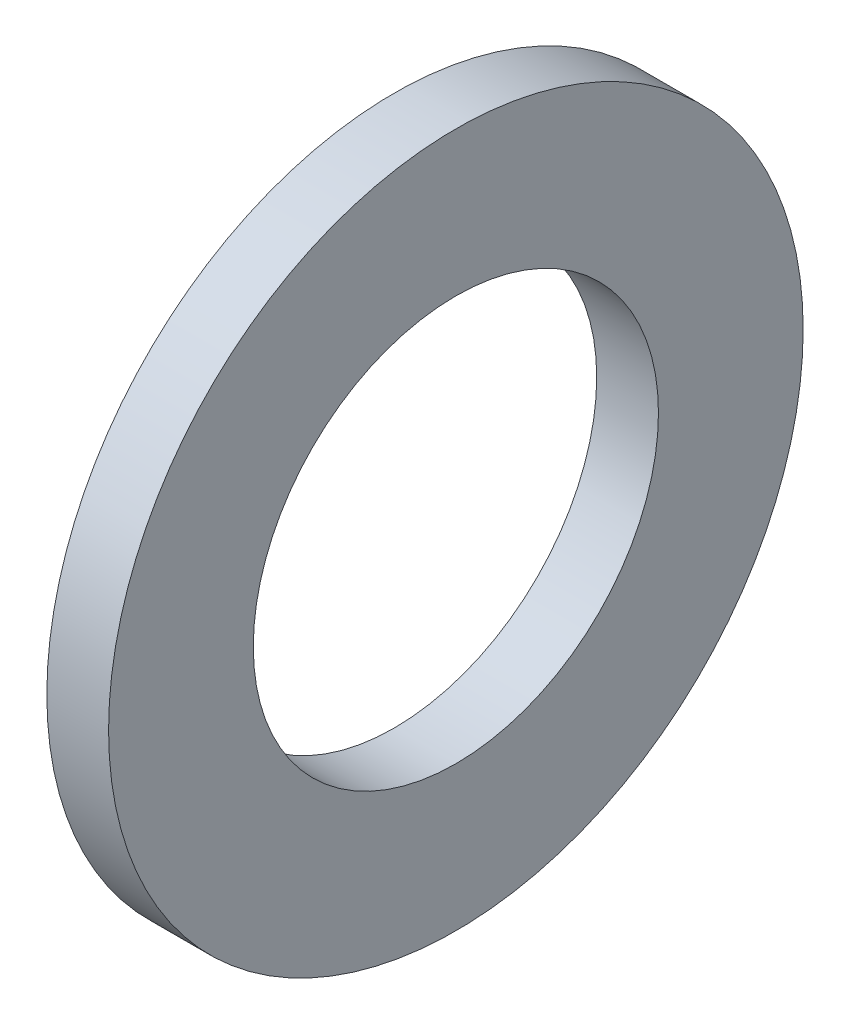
ISO-10303-21;
HEADER;
FILE_DESCRIPTION(('STEP AP214'),'2;1');
FILE_NAME('part.step','',(''),(''),'','','');
FILE_SCHEMA(('AUTOMOTIVE_DESIGN { 1 0 10303 214 1 1 1 1 }'));
ENDSEC;
DATA;
#1=APPLICATION_CONTEXT('core data for automotive mechanical design processes');
#2=APPLICATION_PROTOCOL_DEFINITION('international standard','automotive_design',2000,#1);
#3=PRODUCT_CONTEXT('',#1,'mechanical');
#4=PRODUCT('Part','Part','',(#3));
#5=PRODUCT_RELATED_PRODUCT_CATEGORY('part','',(#4));
#6=PRODUCT_DEFINITION_FORMATION('','',#4);
#7=PRODUCT_DEFINITION_CONTEXT('part definition',#1,'design');
#8=PRODUCT_DEFINITION('design','',#6,#7);
#9=PRODUCT_DEFINITION_SHAPE('','',#8);
#10=(LENGTH_UNIT() NAMED_UNIT(*) SI_UNIT(.MILLI.,.METRE.));
#11=(NAMED_UNIT(*) PLANE_ANGLE_UNIT() SI_UNIT($,.RADIAN.));
#12=(NAMED_UNIT(*) SI_UNIT($,.STERADIAN.) SOLID_ANGLE_UNIT());
#13=UNCERTAINTY_MEASURE_WITH_UNIT(LENGTH_MEASURE(1.E-05),#10,'distance_accuracy_value','');
#14=(GEOMETRIC_REPRESENTATION_CONTEXT(3) GLOBAL_UNCERTAINTY_ASSIGNED_CONTEXT((#13)) GLOBAL_UNIT_ASSIGNED_CONTEXT((#10,
#11,#12)) REPRESENTATION_CONTEXT('',''));
#15=CARTESIAN_POINT('',(0.,0.,0.));
#16=DIRECTION('',(0.,0.,1.));
#17=DIRECTION('',(1.,0.,0.));
#18=AXIS2_PLACEMENT_3D('',#15,#16,#17);
#19=CARTESIAN_POINT('',(-34.9249999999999,0.,0.));
#20=DIRECTION('',(-1.,0.,0.));
#21=DIRECTION('',(0.,0.,1.));
#22=AXIS2_PLACEMENT_3D('',#19,#20,#21);
#23=CYLINDRICAL_SURFACE('',#22,5.25);
#24=CARTESIAN_POINT('',(0.,0.,0.));
#25=DIRECTION('',(-1.,0.,0.));
#26=DIRECTION('',(0.,0.,1.));
#27=AXIS2_PLACEMENT_3D('',#24,#25,#26);
#28=CIRCLE('',#27,5.25);
#29=CARTESIAN_POINT('',(0.,0.,5.25));
#30=VERTEX_POINT('',#29);
#31=EDGE_CURVE('E10',#30,#30,#28,.T.);
#32=ORIENTED_EDGE('',*,*,#31,.F.);
#33=EDGE_LOOP('',(#32));
#34=FACE_BOUND('',#33,.T.);
#35=CARTESIAN_POINT('',(-1.6,0.,0.));
#36=DIRECTION('',(-1.,0.,0.));
#37=DIRECTION('',(0.,0.,1.));
#38=AXIS2_PLACEMENT_3D('',#35,#36,#37);
#39=CIRCLE('',#38,5.25);
#40=CARTESIAN_POINT('',(-1.6,0.,5.25));
#41=VERTEX_POINT('',#40);
#42=EDGE_CURVE('E46',#41,#41,#39,.T.);
#43=ORIENTED_EDGE('',*,*,#42,.T.);
#44=EDGE_LOOP('',(#43));
#45=FACE_BOUND('',#44,.T.);
#46=ADVANCED_FACE('F32',(#34,#45),#23,.F.);
#47=CARTESIAN_POINT('',(0.,5.25,0.));
#48=DIRECTION('',(-1.,0.,0.));
#49=DIRECTION('',(0.,0.,1.));
#50=AXIS2_PLACEMENT_3D('',#47,#48,#49);
#51=PLANE('',#50);
#52=CARTESIAN_POINT('',(0.,0.,0.));
#53=DIRECTION('',(-1.,0.,0.));
#54=DIRECTION('',(0.,0.,1.));
#55=AXIS2_PLACEMENT_3D('',#52,#53,#54);
#56=CIRCLE('',#55,9.);
#57=CARTESIAN_POINT('',(0.,0.,9.));
#58=VERTEX_POINT('',#57);
#59=EDGE_CURVE('E38',#58,#58,#56,.T.);
#60=ORIENTED_EDGE('',*,*,#59,.F.);
#61=EDGE_LOOP('',(#60));
#62=FACE_BOUND('',#61,.T.);
#63=ORIENTED_EDGE('',*,*,#31,.T.);
#64=EDGE_LOOP('',(#63));
#65=FACE_BOUND('',#64,.T.);
#66=ADVANCED_FACE('F61',(#62,#65),#51,.F.);
#67=CARTESIAN_POINT('',(-34.9249999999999,0.,0.));
#68=DIRECTION('',(-1.,0.,0.));
#69=DIRECTION('',(0.,0.,1.));
#70=AXIS2_PLACEMENT_3D('',#67,#68,#69);
#71=CYLINDRICAL_SURFACE('',#70,9.);
#72=CARTESIAN_POINT('',(-1.6,0.,0.));
#73=DIRECTION('',(-1.,0.,0.));
#74=DIRECTION('',(0.,0.,1.));
#75=AXIS2_PLACEMENT_3D('',#72,#73,#74);
#76=CIRCLE('',#75,9.);
#77=CARTESIAN_POINT('',(-1.6,0.,9.));
#78=VERTEX_POINT('',#77);
#79=EDGE_CURVE('E42',#78,#78,#76,.T.);
#80=ORIENTED_EDGE('',*,*,#79,.F.);
#81=EDGE_LOOP('',(#80));
#82=FACE_BOUND('',#81,.T.);
#83=ORIENTED_EDGE('',*,*,#59,.T.);
#84=EDGE_LOOP('',(#83));
#85=FACE_BOUND('',#84,.T.);
#86=ADVANCED_FACE('F56',(#82,#85),#71,.T.);
#87=CARTESIAN_POINT('',(-1.6,9.,0.));
#88=DIRECTION('',(1.,0.,0.));
#89=DIRECTION('',(0.,0.,-1.));
#90=AXIS2_PLACEMENT_3D('',#87,#88,#89);
#91=PLANE('',#90);
#92=ORIENTED_EDGE('',*,*,#42,.F.);
#93=EDGE_LOOP('',(#92));
#94=FACE_BOUND('',#93,.T.);
#95=ORIENTED_EDGE('',*,*,#79,.T.);
#96=EDGE_LOOP('',(#95));
#97=FACE_BOUND('',#96,.T.);
#98=ADVANCED_FACE('F53',(#94,#97),#91,.F.);
#99=CLOSED_SHELL('',(#46,#66,#86,#98));
#100=MANIFOLD_SOLID_BREP('B2',#99);
#101=ADVANCED_BREP_SHAPE_REPRESENTATION('',(#18,#100),#14);
#102=SHAPE_DEFINITION_REPRESENTATION(#9,#101);
ENDSEC;
END-ISO-10303-21;
